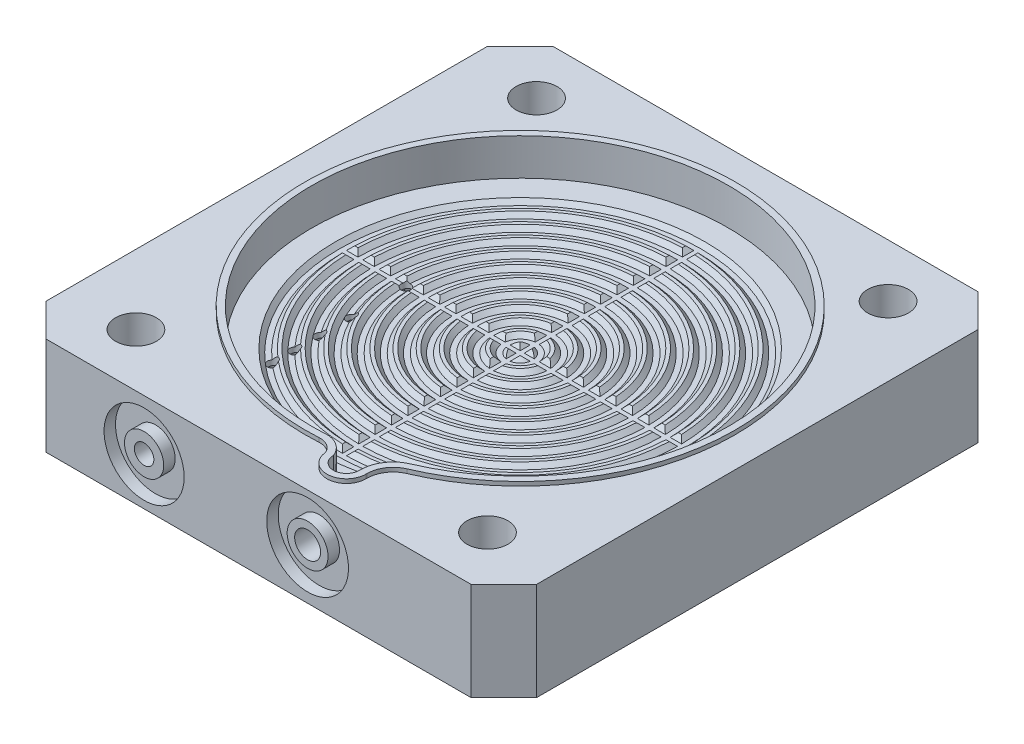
from build123d import *

# Parameters (mm, degrees)
SKETCH1_W                           = 30
SKETCH1_H                           = 31
BOSS_EXTRUDE1_DEPTH                 = 6
SKETCH2_R                           = 12.75
CUT_EXTRUDE1_DEPTH                  = 2
CHAMFER1_SIZE                       = 2
F_3_64_0_04688_DIAMETER_HOLE1_D     = 1.190752
F_3_64_0_04688_DIAMETER_HOLE1_DEPTH = 16.5
F_3_64_0_04688_DIAMETER_HOLE1_TIP   = 0.357737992
F_1_16_0_0625_DIAMETER_HOLE3_D      = 1.5875
F_1_16_0_0625_DIAMETER_HOLE3_DEPTH  = 2.9
F_1_16_0_0625_DIAMETER_HOLE3_TIP    = 0.476933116
SKETCH9_R                           = 2.45
SKETCH9_R_2                         = 1.2
CUT_EXTRUDE2_DEPTH                  = 0.7
SKETCH11_R                          = 2.5
SKETCH11_R_2                        = 1.25
CUT_EXTRUDE4_DEPTH                  = 0.7
CUT_EXTRUDE3_START                  = -10.75
CUT_EXTRUDE3_DEPTH                  = 21.5
M3X0_5_TAPPED_HOLE1_D               = 2.5
LPATTERN1_COUNT                     = 2
LPATTERN1_PITCH                     = 21.5
LPATTERN1_COUNT_DIR2                = 2
LPATTERN1_PITCH_DIR2                = 24.5
CUT_EXTRUDE7_DEPTH                  = 1
CUT_EXTRUDE8_DEPTH                  = 2.2
EXTRUDE_THIN1_START                 = 0.25
EXTRUDE_THIN1_DEPTH                 = 0.25
CUT_EXTRUDE9_DEPTH                  = 1
F_73_0_024_DIAMETER_HOLE1_REACH     = 24.293
F_73_0_024_DIAMETER_HOLE1_BORE_R    = 0.3048
CUT_EXTRUDE10_START                 = -10.75
CUT_EXTRUDE10_DEPTH                 = 21.5


with BuildPart() as part:
    # Sketch1 → Boss-Extrude1 (new body)
    with BuildSketch(Plane(origin=(0, 0, 0), x_dir=(1, 0, 0), z_dir=(0, 1, 0))):
        with Locations((0, -0.5)):
            Rectangle(SKETCH1_W, SKETCH1_H)
    extrude(amount=BOSS_EXTRUDE1_DEPTH)

    # Sketch2 → Cut-Extrude1 (cut)
    with BuildSketch(Plane(origin=(0, 6, 0), x_dir=(1, 0, 0), z_dir=(0, 1, 0))):
        with Locations(Location((0, 0, 0), (0, 0, 270))):
            Circle(SKETCH2_R)
    extrude(amount=-CUT_EXTRUDE1_DEPTH, mode=Mode.SUBTRACT)

    # Sketch3 → Cut-Revolve1 (revolve, cut)
    with BuildSketch(Plane.XY, mode=Mode.PRIVATE) as cut_revolve1_sk:
        Polygon((1.05, 3.75), (1.3, 4), (0.5, 4), (0.75, 3.75), align=None)
        Polygon((2.3, 4), (1.5, 4), (1.75, 3.75), (2.05, 3.75), align=None)
        Polygon((3.3, 4), (2.5, 4), (2.75, 3.75), (3.05, 3.75), align=None)
        Polygon((4.3, 4), (3.5, 4), (3.75, 3.75), (4.05, 3.75), align=None)
        Polygon((5.3, 4), (4.5, 4), (4.75, 3.75), (5.05, 3.75), align=None)
        Polygon((6.3, 4), (5.5, 4), (5.75, 3.75), (6.05, 3.75), align=None)
        Polygon((7.3, 4), (6.5, 4), (6.75, 3.75), (7.05, 3.75), align=None)
        Polygon((8.3, 4), (7.5, 4), (7.75, 3.75), (8.05, 3.75), align=None)
        Polygon((9.3, 4), (8.5, 4), (8.75, 3.75), (9.05, 3.75), align=None)
        Polygon((10.3, 4), (9.5, 4), (9.75, 3.75), (10.05, 3.75), align=None)
        Polygon((11.3, 4), (10.5, 4), (10.75, 3.75), (11.05, 3.75), align=None)
    revolve(cut_revolve1_sk.sketch.rotate(Axis((0, 6.558279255, 0), (0, -1, 0)), 180), axis=Axis((0, 6.558279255, 0), (0, -1, 0)), mode=Mode.SUBTRACT)

    # Chamfer1
    chamfer1_edges = [part.edges().sort_by_distance(p)[0] for p in [
        (-15, 3, -15),
        (15, 3, -15),
        (15, 3, 16),
        (-15, 3, 16),
    ]]
    chamfer(chamfer1_edges, length=CHAMFER1_SIZE)

    # 3_64 _0.04688_ Diameter Hole1
    with Locations(Plane.XY.offset(16)):
        with Locations((-7, 2.9)):
            Hole(F_3_64_0_04688_DIAMETER_HOLE1_D / 2, depth=F_3_64_0_04688_DIAMETER_HOLE1_DEPTH)
            with Locations((0, 0, -(F_3_64_0_04688_DIAMETER_HOLE1_DEPTH + F_3_64_0_04688_DIAMETER_HOLE1_TIP / 2))):  # 118° drill point
                Cone(0, F_3_64_0_04688_DIAMETER_HOLE1_D / 2, F_3_64_0_04688_DIAMETER_HOLE1_TIP, mode=Mode.SUBTRACT)

    # 1_16 _0.0625_ Diameter Hole3
    with Locations(Plane.XY.offset(16)):
        with Locations((3, 3.1)):
            Hole(F_1_16_0_0625_DIAMETER_HOLE3_D / 2, depth=F_1_16_0_0625_DIAMETER_HOLE3_DEPTH)
            with Locations((0, 0, -(F_1_16_0_0625_DIAMETER_HOLE3_DEPTH + F_1_16_0_0625_DIAMETER_HOLE3_TIP / 2))):  # 118° drill point
                Cone(0, F_1_16_0_0625_DIAMETER_HOLE3_D / 2, F_1_16_0_0625_DIAMETER_HOLE3_TIP, mode=Mode.SUBTRACT)

    # Sketch9 → Cut-Extrude2 (cut)
    with BuildSketch(Plane.XY.offset(16)):
        with Locations((-7, 2.9)):
            Circle(SKETCH9_R)
        with Locations((-7, 2.9)):
            Circle(SKETCH9_R_2, mode=Mode.SUBTRACT)
    extrude(amount=-CUT_EXTRUDE2_DEPTH, mode=Mode.SUBTRACT)

    # Sketch11 → Cut-Extrude4 (cut)
    with BuildSketch(Plane(origin=(0, 14, 16), x_dir=(1, 0, 0), z_dir=(0, 0, 1))):
        with Locations((3, -10.9)):
            Circle(SKETCH11_R)
        with Locations((3, -10.9)):
            Circle(SKETCH11_R_2, mode=Mode.SUBTRACT)
    extrude(amount=-CUT_EXTRUDE4_DEPTH, mode=Mode.SUBTRACT)

    # Sketch10 → Cut-Extrude3 (cut)
    with BuildSketch(Plane(origin=(0, 4, 0), x_dir=(1, 0, 0), z_dir=(0, 0, -1)).offset(CUT_EXTRUDE3_START)):
        Polygon((0.125, 0.25), (0.375, 0), (-0.375, 0), (-0.125, 0.25), align=None)
    extrude(amount=CUT_EXTRUDE3_DEPTH, mode=Mode.SUBTRACT)

    # M3x0.5 Tapped Hole1 (through all)
    with Locations(Plane(origin=(0, 6, 0), x_dir=(-1, 0, 0), z_dir=(0, 1, 0))):
        with Locations((10.75, 12.75)):
            m3x0_5_tapped_hole1 = Hole(M3X0_5_TAPPED_HOLE1_D / 2)

    # LPattern1: M3x0.5 Tapped Hole1 2 × 2
    with Locations(*[(i * LPATTERN1_PITCH, 0, -j * LPATTERN1_PITCH_DIR2) for i in range(LPATTERN1_COUNT) for j in range(LPATTERN1_COUNT_DIR2) if (i, j) != (0, 0)]):
        add(m3x0_5_tapped_hole1, mode=Mode.SUBTRACT)

    # Sketch31 → Cut-Extrude7 (cut)
    with BuildSketch(Plane(origin=(0, 6, 0), x_dir=(1, 0, 0), z_dir=(0, 1, 0))):
        with BuildLine():
            Line((2.20625, -13.625), (2.20625, -10.875))
            ThreePointArc((2.20625, -10.875), (3, -10.08125), (3.79375, -10.875))
            Line((3.79375, -10.875), (3.79375, -13.625))
            ThreePointArc((3.79375, -13.625), (3, -14.41875), (2.20625, -13.625))
        make_face()
    extrude(amount=-CUT_EXTRUDE7_DEPTH, mode=Mode.SUBTRACT)

    # Sketch32 → Cut-Extrude8 (cut)
    with BuildSketch(Plane(origin=(0, 5, 0), x_dir=(1, 0, 0), z_dir=(0, 1, 0))):
        with BuildLine():
            Line((2.20625, -13.625), (2.20625, -13.475))
            ThreePointArc((2.20625, -13.475), (3, -12.68125), (3.79375, -13.475))
            Line((3.79375, -13.475), (3.79375, -13.625))
            ThreePointArc((3.79375, -13.625), (3, -14.41875), (2.20625, -13.625))
        make_face()
    extrude(amount=-CUT_EXTRUDE8_DEPTH, mode=Mode.SUBTRACT)

    # Sketch35 → Extrude-Thin1 (add)
    with BuildSketch(Plane(origin=(0, 6, 0), x_dir=(1, 0, 0), z_dir=(0, 1, 0)).offset(EXTRUDE_THIN1_START)):
        with BuildLine():
            ThreePointArc((5.165275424, -12.093073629), (-3.043488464, 12.792954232), (0.833844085, -13.123536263))
            ThreePointArc((0.833844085, -13.123536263), (1.413546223, -13.265110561), (1.809399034, -13.711651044))
            ThreePointArc((1.809399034, -13.711651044), (3.043354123, -14.817962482), (4.19375, -13.625))
            Line((4.19375, -13.625), (4.19375, -13.564474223))
            ThreePointArc((4.19375, -13.564474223), (4.458542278, -12.682873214), (5.165275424, -12.093073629))
        make_face()
        with BuildLine():
            ThreePointArc((5.00815678, -11.725223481), (-2.950910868, 12.403814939), (0.808480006, -12.724341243))
            ThreePointArc((0.808480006, -12.724341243), (1.655562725, -12.944676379), (2.20625, -13.625))
            ThreePointArc((2.20625, -13.625), (3, -14.41875), (3.79375, -13.625))
            Line((3.79375, -13.625), (3.79375, -13.564474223))
            ThreePointArc((3.79375, -13.564474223), (4.124740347, -12.462472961), (5.00815678, -11.725223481))
        make_face(mode=Mode.SUBTRACT)
    extrude(amount=-EXTRUDE_THIN1_DEPTH)

    # Sketch36 → Cut-Extrude9 (cut)
    with BuildSketch(Plane(origin=(0, 6, 0), x_dir=(1, 0, 0), z_dir=(0, 1, 0))):
        with BuildLine():
            Line((2.20625, -13.625), (2.20625, -12.557665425))
            ThreePointArc((2.20625, -12.557665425), (1.509667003, -12.660308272), (0.808480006, -12.724341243))
            ThreePointArc((0.808480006, -12.724341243), (1.655562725, -12.944676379), (2.20625, -13.625))
        make_face()
        with BuildLine():
            Line((3.79375, -12.172508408), (3.79375, -13.564474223))
            ThreePointArc((3.79375, -13.564474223), (4.124740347, -12.462472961), (5.00815678, -11.725223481))
            ThreePointArc((5.00815678, -11.725223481), (4.406632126, -11.96428407), (3.79375, -12.172508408))
        make_face()
    extrude(amount=-CUT_EXTRUDE9_DEPTH, mode=Mode.SUBTRACT)

    # 73 _0.024_ Diameter Hole1 bore → 73 _0.024_ Diameter Hole1 (cut, up to next)
    with BuildSketch(Plane(origin=(0, 4, 0), x_dir=(-1, 0, 0), z_dir=(0, 1, 0)), mode=Mode.PRIVATE) as f_73_0_024_diameter_hole1_sk1:
        with Locations((7, 0)):
            Circle(F_73_0_024_DIAMETER_HOLE1_BORE_R)
    f_73_0_024_diameter_hole1_tool1 = extrude(f_73_0_024_diameter_hole1_sk1.sketch, amount=-F_73_0_024_DIAMETER_HOLE1_REACH, mode=Mode.PRIVATE) & part.part
    # 73 _0.024_ Diameter Hole1 bore → 73 _0.024_ Diameter Hole1 (cut, up to next)
    with BuildSketch(Plane(origin=(0, 4, 0), x_dir=(-1, 0, 0), z_dir=(0, 1, 0)), mode=Mode.PRIVATE) as f_73_0_024_diameter_hole1_sk2:
        with Locations((7, 3.326033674)):
            Circle(F_73_0_024_DIAMETER_HOLE1_BORE_R)
    f_73_0_024_diameter_hole1_tool2 = extrude(f_73_0_024_diameter_hole1_sk2.sketch, amount=-F_73_0_024_DIAMETER_HOLE1_REACH, mode=Mode.PRIVATE) & part.part
    # 73 _0.024_ Diameter Hole1 bore → 73 _0.024_ Diameter Hole1 (cut, up to next)
    with BuildSketch(Plane(origin=(0, 4, 0), x_dir=(-1, 0, 0), z_dir=(0, 1, 0)), mode=Mode.PRIVATE) as f_73_0_024_diameter_hole1_sk3:
        with Locations((7, 5.25)):
            Circle(F_73_0_024_DIAMETER_HOLE1_BORE_R)
    f_73_0_024_diameter_hole1_tool3 = extrude(f_73_0_024_diameter_hole1_sk3.sketch, amount=-F_73_0_024_DIAMETER_HOLE1_REACH, mode=Mode.PRIVATE) & part.part
    # 73 _0.024_ Diameter Hole1 bore → 73 _0.024_ Diameter Hole1 (cut, up to next)
    with BuildSketch(Plane(origin=(0, 4, 0), x_dir=(-1, 0, 0), z_dir=(0, 1, 0)), mode=Mode.PRIVATE) as f_73_0_024_diameter_hole1_sk4:
        with Locations((7, 6.78693598)):
            Circle(F_73_0_024_DIAMETER_HOLE1_BORE_R)
    f_73_0_024_diameter_hole1_tool4 = extrude(f_73_0_024_diameter_hole1_sk4.sketch, amount=-F_73_0_024_DIAMETER_HOLE1_REACH, mode=Mode.PRIVATE) & part.part
    # 73 _0.024_ Diameter Hole1 bore → 73 _0.024_ Diameter Hole1 (cut, up to next)
    with BuildSketch(Plane(origin=(0, 4, 0), x_dir=(-1, 0, 0), z_dir=(0, 1, 0)), mode=Mode.PRIVATE) as f_73_0_024_diameter_hole1_sk5:
        with Locations((7, 8.158584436)):
            Circle(F_73_0_024_DIAMETER_HOLE1_BORE_R)
    f_73_0_024_diameter_hole1_tool5 = extrude(f_73_0_024_diameter_hole1_sk5.sketch, amount=-F_73_0_024_DIAMETER_HOLE1_REACH, mode=Mode.PRIVATE) & part.part
    add(f_73_0_024_diameter_hole1_tool1.solids().sort_by_distance((-7, 4, 0))[0], mode=Mode.SUBTRACT)
    add(f_73_0_024_diameter_hole1_tool2.solids().sort_by_distance((-7, 4, 3.326034))[0], mode=Mode.SUBTRACT)
    add(f_73_0_024_diameter_hole1_tool3.solids().sort_by_distance((-7, 4, 5.25))[0], mode=Mode.SUBTRACT)
    add(f_73_0_024_diameter_hole1_tool4.solids().sort_by_distance((-7, 4, 6.786936))[0], mode=Mode.SUBTRACT)
    add(f_73_0_024_diameter_hole1_tool5.solids().sort_by_distance((-7, 4, 8.158584))[0], mode=Mode.SUBTRACT)

    # Sketch64 → Cut-Extrude10 (cut)
    with BuildSketch(Plane(origin=(0, -18, 0), x_dir=(0, 0, -1), z_dir=(1, 0, 0)).offset(CUT_EXTRUDE10_START)):
        Polygon((-0.125, 21.75), (-0.375, 22), (0.375, 22), (0.125, 21.75), align=None)
    extrude(amount=CUT_EXTRUDE10_DEPTH, mode=Mode.SUBTRACT)


solid = part.part
